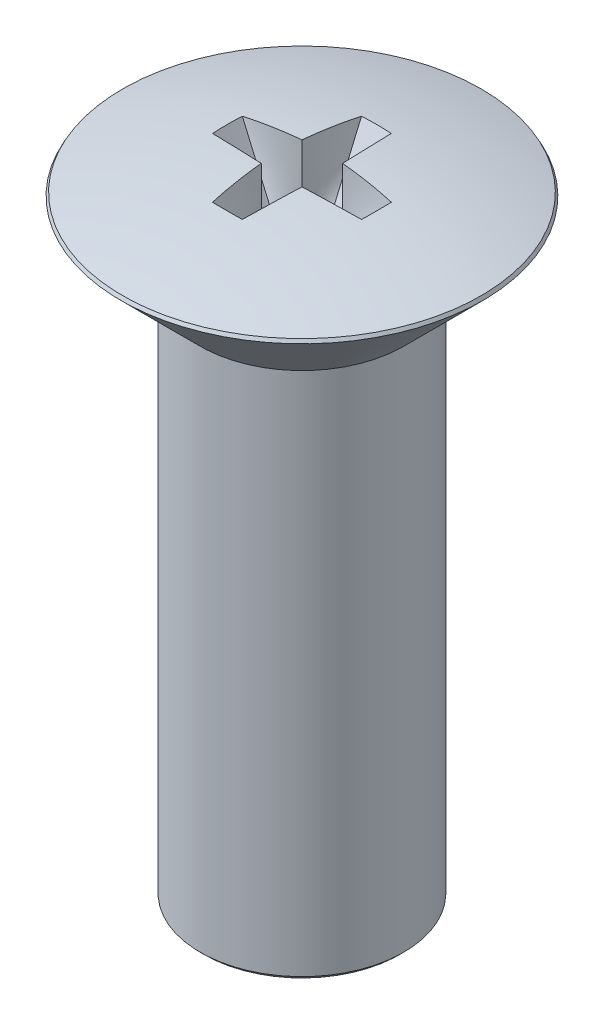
ISO-10303-21;
HEADER;
FILE_DESCRIPTION(('STEP AP214'),'2;1');
FILE_NAME('part.step','',(''),(''),'','','');
FILE_SCHEMA(('AUTOMOTIVE_DESIGN { 1 0 10303 214 1 1 1 1 }'));
ENDSEC;
DATA;
#1=APPLICATION_CONTEXT('core data for automotive mechanical design processes');
#2=APPLICATION_PROTOCOL_DEFINITION('international standard','automotive_design',2000,#1);
#3=PRODUCT_CONTEXT('',#1,'mechanical');
#4=PRODUCT('Part','Part','',(#3));
#5=PRODUCT_RELATED_PRODUCT_CATEGORY('part','',(#4));
#6=PRODUCT_DEFINITION_FORMATION('','',#4);
#7=PRODUCT_DEFINITION_CONTEXT('part definition',#1,'design');
#8=PRODUCT_DEFINITION('design','',#6,#7);
#9=PRODUCT_DEFINITION_SHAPE('','',#8);
#10=(LENGTH_UNIT() NAMED_UNIT(*) SI_UNIT(.MILLI.,.METRE.));
#11=(NAMED_UNIT(*) PLANE_ANGLE_UNIT() SI_UNIT($,.RADIAN.));
#12=(NAMED_UNIT(*) SI_UNIT($,.STERADIAN.) SOLID_ANGLE_UNIT());
#13=UNCERTAINTY_MEASURE_WITH_UNIT(LENGTH_MEASURE(1.E-05),#10,'distance_accuracy_value','');
#14=(GEOMETRIC_REPRESENTATION_CONTEXT(3) GLOBAL_UNCERTAINTY_ASSIGNED_CONTEXT((#13)) GLOBAL_UNIT_ASSIGNED_CONTEXT((#10,
#11,#12)) REPRESENTATION_CONTEXT('',''));
#15=CARTESIAN_POINT('',(0.,0.,0.));
#16=DIRECTION('',(0.,0.,1.));
#17=DIRECTION('',(1.,0.,0.));
#18=AXIS2_PLACEMENT_3D('',#15,#16,#17);
#19=CARTESIAN_POINT('',(0.,0.,0.));
#20=DIRECTION('',(0.,-1.,0.));
#21=DIRECTION('',(0.,0.,-1.));
#22=AXIS2_PLACEMENT_3D('',#19,#20,#21);
#23=PLANE('',#22);
#24=CARTESIAN_POINT('',(0.,0.,0.));
#25=DIRECTION('',(0.,-1.,0.));
#26=DIRECTION('',(0.,0.,-1.));
#27=AXIS2_PLACEMENT_3D('',#24,#25,#26);
#28=CIRCLE('',#27,2.4);
#29=CARTESIAN_POINT('',(0.,0.,-2.4));
#30=VERTEX_POINT('',#29);
#31=EDGE_CURVE('E40',#30,#30,#28,.T.);
#32=ORIENTED_EDGE('',*,*,#31,.T.);
#33=EDGE_LOOP('',(#32));
#34=FACE_BOUND('',#33,.T.);
#35=ADVANCED_FACE('F32',(#34),#23,.T.);
#36=CARTESIAN_POINT('',(0.,0.,0.));
#37=DIRECTION('',(0.,-1.,0.));
#38=DIRECTION('',(0.,0.,-1.));
#39=AXIS2_PLACEMENT_3D('',#36,#37,#38);
#40=CYLINDRICAL_SURFACE('',#39,2.5);
#41=CARTESIAN_POINT('',(0.,0.1,0.));
#42=DIRECTION('',(0.,-1.,0.));
#43=DIRECTION('',(0.,0.,-1.));
#44=AXIS2_PLACEMENT_3D('',#41,#42,#43);
#45=CIRCLE('',#44,2.5);
#46=CARTESIAN_POINT('',(0.,0.1,-2.5));
#47=VERTEX_POINT('',#46);
#48=EDGE_CURVE('E11',#47,#47,#45,.F.);
#49=ORIENTED_EDGE('',*,*,#48,.T.);
#50=EDGE_LOOP('',(#49));
#51=FACE_BOUND('',#50,.T.);
#52=CARTESIAN_POINT('',(0.,13.,0.));
#53=DIRECTION('',(0.,-1.,0.));
#54=DIRECTION('',(0.,0.,-1.));
#55=AXIS2_PLACEMENT_3D('',#52,#53,#54);
#56=CIRCLE('',#55,2.5);
#57=CARTESIAN_POINT('',(0.,13.,-2.5));
#58=VERTEX_POINT('',#57);
#59=EDGE_CURVE('E127',#58,#58,#56,.T.);
#60=ORIENTED_EDGE('',*,*,#59,.T.);
#61=EDGE_LOOP('',(#60));
#62=FACE_BOUND('',#61,.T.);
#63=ADVANCED_FACE('F282',(#51,#62),#40,.T.);
#64=CARTESIAN_POINT('',(0.,13.,0.));
#65=DIRECTION('',(0.,1.,0.));
#66=DIRECTION('',(0.,0.,1.));
#67=AXIS2_PLACEMENT_3D('',#64,#65,#66);
#68=CONICAL_SURFACE('',#67,2.5,0.785398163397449);
#69=CARTESIAN_POINT('',(0.,14.9477984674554,0.));
#70=DIRECTION('',(0.,-1.,0.));
#71=DIRECTION('',(0.,0.,-1.));
#72=AXIS2_PLACEMENT_3D('',#69,#70,#71);
#73=CIRCLE('',#72,4.44779846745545);
#74=CARTESIAN_POINT('',(0.,14.9477984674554,-4.44779846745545));
#75=VERTEX_POINT('',#74);
#76=EDGE_CURVE('E340',#75,#75,#73,.T.);
#77=ORIENTED_EDGE('',*,*,#76,.T.);
#78=EDGE_LOOP('',(#77));
#79=FACE_BOUND('',#78,.T.);
#80=ORIENTED_EDGE('',*,*,#59,.F.);
#81=EDGE_LOOP('',(#80));
#82=FACE_BOUND('',#81,.T.);
#83=ADVANCED_FACE('F284',(#79,#82),#68,.T.);
#84=CARTESIAN_POINT('',(0.,0.,0.));
#85=DIRECTION('',(0.,-1.,0.));
#86=DIRECTION('',(1.,0.,0.));
#87=AXIS2_PLACEMENT_3D('',#84,#85,#86);
#88=SPHERICAL_SURFACE('',#87,15.6604597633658);
#89=CARTESIAN_POINT('',(0.,15.0283397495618,0.));
#90=DIRECTION('',(0.,-1.,0.));
#91=DIRECTION('',(0.,0.,-1.));
#92=AXIS2_PLACEMENT_3D('',#89,#90,#91);
#93=CIRCLE('',#92,4.40443008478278);
#94=CARTESIAN_POINT('',(0.,15.0283397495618,-4.40443008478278));
#95=VERTEX_POINT('',#94);
#96=EDGE_CURVE('E346',#95,#95,#93,.F.);
#97=ORIENTED_EDGE('',*,*,#96,.T.);
#98=EDGE_LOOP('',(#97));
#99=FACE_BOUND('',#98,.T.);
#100=CARTESIAN_POINT('',(-0.5,15.644487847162,0.5));
#101=CARTESIAN_POINT('',(-0.484660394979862,15.6378651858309,0.72265930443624));
#102=CARTESIAN_POINT('',(-0.466348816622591,15.6265602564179,0.944985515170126));
#103=CARTESIAN_POINT('',(-0.433294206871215,15.6026379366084,1.27767889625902));
#104=CARTESIAN_POINT('',(-0.421326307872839,15.5934871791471,1.38858230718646));
#105=CARTESIAN_POINT('',(-0.395332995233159,15.572864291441,1.61001796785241));
#106=CARTESIAN_POINT('',(-0.381306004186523,15.5613903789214,1.72054986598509));
#107=CARTESIAN_POINT('',(-0.366160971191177,15.5487645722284,1.83080485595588));
#108=B_SPLINE_CURVE_WITH_KNOTS('',3,(#100,#101,#102,#103,#104,#105,#106,#107),.UNSPECIFIED.,.F.,
.F.,(4,2,2,4),(0.,0.669772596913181,1.00550014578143,1.3414862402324),.UNSPECIFIED.);
#109=CARTESIAN_POINT('',(-0.5,15.644487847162,0.5));
#110=VERTEX_POINT('',#109);
#111=CARTESIAN_POINT('',(-0.366160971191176,15.5487645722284,1.83080485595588));
#112=VERTEX_POINT('',#111);
#113=EDGE_CURVE('E334',#110,#112,#108,.T.);
#114=ORIENTED_EDGE('',*,*,#113,.F.);
#115=CARTESIAN_POINT('',(-1.83080485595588,15.5487645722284,0.366160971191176));
#116=CARTESIAN_POINT('',(-1.71093724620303,15.562491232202,0.382628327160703));
#117=CARTESIAN_POINT('',(-1.59074226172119,15.5748562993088,0.397772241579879));
#118=CARTESIAN_POINT('',(-1.34982389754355,15.5968462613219,0.425653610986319));
#119=CARTESIAN_POINT('',(-1.22910052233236,15.606471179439,0.438391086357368));
#120=CARTESIAN_POINT('',(-0.905917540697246,15.6285105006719,0.4695389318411));
#121=CARTESIAN_POINT('',(-0.703094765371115,15.6384470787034,0.486002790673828));
#122=CARTESIAN_POINT('',(-0.5,15.644487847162,0.5));
#123=B_SPLINE_CURVE_WITH_KNOTS('',3,(#115,#116,#117,#118,#119,#120,#121,#122),.UNSPECIFIED.,.F.,
.F.,(4,2,2,4),(0.,0.365276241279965,0.730549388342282,1.34149837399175),.UNSPECIFIED.);
#124=CARTESIAN_POINT('',(-1.83080485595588,15.5487645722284,0.366160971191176));
#125=VERTEX_POINT('',#124);
#126=EDGE_CURVE('E55',#125,#110,#123,.T.);
#127=ORIENTED_EDGE('',*,*,#126,.F.);
#128=CARTESIAN_POINT('',(-1.83080485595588,15.5487645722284,-0.366160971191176));
#129=CARTESIAN_POINT('',(-1.83406202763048,15.5503422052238,-0.282893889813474));
#130=CARTESIAN_POINT('',(-1.83620737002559,15.5513813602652,-0.199573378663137));
#131=CARTESIAN_POINT('',(-1.83823787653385,15.5523649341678,-0.0358571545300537));
#132=CARTESIAN_POINT('',(-1.83820057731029,15.5523469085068,0.0445373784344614));
#133=CARTESIAN_POINT('',(-1.83605684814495,15.5513085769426,0.20535824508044));
#134=CARTESIAN_POINT('',(-1.83394872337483,15.5502874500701,0.285784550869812));
#135=CARTESIAN_POINT('',(-1.83080485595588,15.5487645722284,0.366160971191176));
#136=B_SPLINE_CURVE_WITH_KNOTS('',3,(#128,#129,#130,#131,#132,#133,#134,#135),.UNSPECIFIED.,.F.,
.F.,(4,2,2,4),(0.,0.250027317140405,0.49117818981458,0.732526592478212),.UNSPECIFIED.);
#137=CARTESIAN_POINT('',(-1.83080485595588,15.5487645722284,-0.366160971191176));
#138=VERTEX_POINT('',#137);
#139=EDGE_CURVE('E181',#138,#125,#136,.T.);
#140=ORIENTED_EDGE('',*,*,#139,.F.);
#141=CARTESIAN_POINT('',(-0.5,15.644487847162,-0.5));
#142=CARTESIAN_POINT('',(-0.722659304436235,15.6378651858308,-0.484660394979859));
#143=CARTESIAN_POINT('',(-0.944985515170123,15.6265602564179,-0.466348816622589));
#144=CARTESIAN_POINT('',(-1.27767889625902,15.6026379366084,-0.433294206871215));
#145=CARTESIAN_POINT('',(-1.38858230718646,15.5934871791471,-0.421326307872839));
#146=CARTESIAN_POINT('',(-1.61001796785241,15.572864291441,-0.39533299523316));
#147=CARTESIAN_POINT('',(-1.72054986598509,15.5613903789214,-0.381306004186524));
#148=CARTESIAN_POINT('',(-1.83080485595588,15.5487645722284,-0.366160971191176));
#149=B_SPLINE_CURVE_WITH_KNOTS('',3,(#141,#142,#143,#144,#145,#146,#147,#148),.UNSPECIFIED.,.F.,
.F.,(4,2,2,4),(0.,0.66977259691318,1.00550014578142,1.3414862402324),.UNSPECIFIED.);
#150=CARTESIAN_POINT('',(-0.5,15.644487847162,-0.5));
#151=VERTEX_POINT('',#150);
#152=EDGE_CURVE('E403',#151,#138,#149,.T.);
#153=ORIENTED_EDGE('',*,*,#152,.F.);
#154=CARTESIAN_POINT('',(-0.366160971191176,15.5487645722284,-1.83080485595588));
#155=CARTESIAN_POINT('',(-0.382628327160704,15.562491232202,-1.71093724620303));
#156=CARTESIAN_POINT('',(-0.397772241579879,15.5748562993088,-1.59074226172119));
#157=CARTESIAN_POINT('',(-0.425653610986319,15.5968462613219,-1.34982389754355));
#158=CARTESIAN_POINT('',(-0.438391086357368,15.606471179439,-1.22910052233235));
#159=CARTESIAN_POINT('',(-0.4695389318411,15.6285105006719,-0.905917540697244));
#160=CARTESIAN_POINT('',(-0.486002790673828,15.6384470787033,-0.703094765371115));
#161=CARTESIAN_POINT('',(-0.5,15.644487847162,-0.5));
#162=B_SPLINE_CURVE_WITH_KNOTS('',3,(#154,#155,#156,#157,#158,#159,#160,#161),.UNSPECIFIED.,.F.,
.F.,(4,2,2,4),(0.,0.365276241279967,0.730549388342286,1.34149837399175),.UNSPECIFIED.);
#163=CARTESIAN_POINT('',(-0.366160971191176,15.5487645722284,-1.83080485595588));
#164=VERTEX_POINT('',#163);
#165=EDGE_CURVE('E216',#164,#151,#162,.T.);
#166=ORIENTED_EDGE('',*,*,#165,.F.);
#167=CARTESIAN_POINT('',(0.366160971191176,15.5487645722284,-1.83080485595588));
#168=CARTESIAN_POINT('',(0.282893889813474,15.5503422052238,-1.83406202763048));
#169=CARTESIAN_POINT('',(0.199573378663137,15.5513813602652,-1.83620737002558));
#170=CARTESIAN_POINT('',(0.0358571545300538,15.5523649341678,-1.83823787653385));
#171=CARTESIAN_POINT('',(-0.0445373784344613,15.5523469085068,-1.83820057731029));
#172=CARTESIAN_POINT('',(-0.20535824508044,15.5513085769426,-1.83605684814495));
#173=CARTESIAN_POINT('',(-0.285784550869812,15.5502874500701,-1.83394872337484));
#174=CARTESIAN_POINT('',(-0.366160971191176,15.5487645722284,-1.83080485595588));
#175=B_SPLINE_CURVE_WITH_KNOTS('',3,(#167,#168,#169,#170,#171,#172,#173,#174),.UNSPECIFIED.,.F.,
.F.,(4,2,2,4),(0.,0.250027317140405,0.49117818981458,0.732526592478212),.UNSPECIFIED.);
#176=CARTESIAN_POINT('',(0.366160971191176,15.5487645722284,-1.83080485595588));
#177=VERTEX_POINT('',#176);
#178=EDGE_CURVE('E209',#177,#164,#175,.T.);
#179=ORIENTED_EDGE('',*,*,#178,.F.);
#180=CARTESIAN_POINT('',(0.5,15.644487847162,-0.5));
#181=CARTESIAN_POINT('',(0.484660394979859,15.6378651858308,-0.722659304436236));
#182=CARTESIAN_POINT('',(0.466348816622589,15.6265602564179,-0.944985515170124));
#183=CARTESIAN_POINT('',(0.433294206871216,15.6026379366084,-1.27767889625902));
#184=CARTESIAN_POINT('',(0.42132630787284,15.5934871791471,-1.38858230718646));
#185=CARTESIAN_POINT('',(0.39533299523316,15.572864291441,-1.61001796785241));
#186=CARTESIAN_POINT('',(0.381306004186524,15.5613903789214,-1.72054986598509));
#187=CARTESIAN_POINT('',(0.366160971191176,15.5487645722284,-1.83080485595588));
#188=B_SPLINE_CURVE_WITH_KNOTS('',3,(#180,#181,#182,#183,#184,#185,#186,#187),.UNSPECIFIED.,.F.,
.F.,(4,2,2,4),(0.,0.669772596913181,1.00550014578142,1.3414862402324),.UNSPECIFIED.);
#189=CARTESIAN_POINT('',(0.5,15.644487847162,-0.5));
#190=VERTEX_POINT('',#189);
#191=EDGE_CURVE('E205',#190,#177,#188,.T.);
#192=ORIENTED_EDGE('',*,*,#191,.F.);
#193=CARTESIAN_POINT('',(1.83080485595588,15.5487645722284,-0.366160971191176));
#194=CARTESIAN_POINT('',(1.71093724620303,15.562491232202,-0.382628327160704));
#195=CARTESIAN_POINT('',(1.59074226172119,15.5748562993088,-0.39777224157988));
#196=CARTESIAN_POINT('',(1.34982389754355,15.5968462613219,-0.42565361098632));
#197=CARTESIAN_POINT('',(1.22910052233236,15.606471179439,-0.438391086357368));
#198=CARTESIAN_POINT('',(0.905917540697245,15.6285105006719,-0.4695389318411));
#199=CARTESIAN_POINT('',(0.703094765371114,15.6384470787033,-0.486002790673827));
#200=CARTESIAN_POINT('',(0.5,15.644487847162,-0.5));
#201=B_SPLINE_CURVE_WITH_KNOTS('',3,(#193,#194,#195,#196,#197,#198,#199,#200),.UNSPECIFIED.,.F.,
.F.,(4,2,2,4),(0.,0.365276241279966,0.730549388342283,1.34149837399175),.UNSPECIFIED.);
#202=CARTESIAN_POINT('',(1.83080485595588,15.5487645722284,-0.366160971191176));
#203=VERTEX_POINT('',#202);
#204=EDGE_CURVE('E218',#203,#190,#201,.T.);
#205=ORIENTED_EDGE('',*,*,#204,.F.);
#206=CARTESIAN_POINT('',(1.83080485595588,15.5487645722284,0.366160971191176));
#207=CARTESIAN_POINT('',(1.83406202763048,15.5503422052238,0.282893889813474));
#208=CARTESIAN_POINT('',(1.83620737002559,15.5513813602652,0.199573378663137));
#209=CARTESIAN_POINT('',(1.83823787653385,15.5523649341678,0.0358571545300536));
#210=CARTESIAN_POINT('',(1.83820057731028,15.5523469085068,-0.0445373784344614));
#211=CARTESIAN_POINT('',(1.83605684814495,15.5513085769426,-0.20535824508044));
#212=CARTESIAN_POINT('',(1.83394872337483,15.5502874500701,-0.285784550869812));
#213=CARTESIAN_POINT('',(1.83080485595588,15.5487645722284,-0.366160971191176));
#214=B_SPLINE_CURVE_WITH_KNOTS('',3,(#206,#207,#208,#209,#210,#211,#212,#213),.UNSPECIFIED.,.F.,
.F.,(4,2,2,4),(0.,0.250027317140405,0.49117818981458,0.732526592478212),.UNSPECIFIED.);
#215=CARTESIAN_POINT('',(1.83080485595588,15.5487645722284,0.366160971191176));
#216=VERTEX_POINT('',#215);
#217=EDGE_CURVE('E217',#216,#203,#214,.T.);
#218=ORIENTED_EDGE('',*,*,#217,.F.);
#219=CARTESIAN_POINT('',(0.5,15.644487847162,0.5));
#220=CARTESIAN_POINT('',(0.722659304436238,15.6378651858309,0.484660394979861));
#221=CARTESIAN_POINT('',(0.944985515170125,15.6265602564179,0.46634881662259));
#222=CARTESIAN_POINT('',(1.27767889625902,15.6026379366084,0.433294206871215));
#223=CARTESIAN_POINT('',(1.38858230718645,15.5934871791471,0.421326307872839));
#224=CARTESIAN_POINT('',(1.61001796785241,15.572864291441,0.395332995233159));
#225=CARTESIAN_POINT('',(1.72054986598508,15.5613903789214,0.381306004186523));
#226=CARTESIAN_POINT('',(1.83080485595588,15.5487645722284,0.366160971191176));
#227=B_SPLINE_CURVE_WITH_KNOTS('',3,(#219,#220,#221,#222,#223,#224,#225,#226),.UNSPECIFIED.,.F.,
.F.,(4,2,2,4),(0.,0.66977259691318,1.00550014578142,1.3414862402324),.UNSPECIFIED.);
#228=CARTESIAN_POINT('',(0.5,15.644487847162,0.5));
#229=VERTEX_POINT('',#228);
#230=EDGE_CURVE('E408',#229,#216,#227,.T.);
#231=ORIENTED_EDGE('',*,*,#230,.F.);
#232=CARTESIAN_POINT('',(0.366160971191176,15.5487645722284,1.83080485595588));
#233=CARTESIAN_POINT('',(0.382628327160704,15.562491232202,1.71093724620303));
#234=CARTESIAN_POINT('',(0.397772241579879,15.5748562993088,1.59074226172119));
#235=CARTESIAN_POINT('',(0.425653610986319,15.5968462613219,1.34982389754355));
#236=CARTESIAN_POINT('',(0.438391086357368,15.606471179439,1.22910052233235));
#237=CARTESIAN_POINT('',(0.4695389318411,15.6285105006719,0.905917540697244));
#238=CARTESIAN_POINT('',(0.486002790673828,15.6384470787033,0.703094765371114));
#239=CARTESIAN_POINT('',(0.5,15.644487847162,0.5));
#240=B_SPLINE_CURVE_WITH_KNOTS('',3,(#232,#233,#234,#235,#236,#237,#238,#239),.UNSPECIFIED.,.F.,
.F.,(4,2,2,4),(0.,0.365276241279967,0.730549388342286,1.34149837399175),.UNSPECIFIED.);
#241=CARTESIAN_POINT('',(0.366160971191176,15.5487645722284,1.83080485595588));
#242=VERTEX_POINT('',#241);
#243=EDGE_CURVE('E398',#242,#229,#240,.T.);
#244=ORIENTED_EDGE('',*,*,#243,.F.);
#245=CARTESIAN_POINT('',(-0.366160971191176,15.5487645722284,1.83080485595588));
#246=CARTESIAN_POINT('',(-0.282893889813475,15.5503422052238,1.83406202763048));
#247=CARTESIAN_POINT('',(-0.199573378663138,15.5513813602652,1.83620737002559));
#248=CARTESIAN_POINT('',(-0.0358571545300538,15.5523649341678,1.83823787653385));
#249=CARTESIAN_POINT('',(0.0445373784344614,15.5523469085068,1.83820057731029));
#250=CARTESIAN_POINT('',(0.205358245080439,15.5513085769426,1.83605684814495));
#251=CARTESIAN_POINT('',(0.285784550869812,15.5502874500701,1.83394872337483));
#252=CARTESIAN_POINT('',(0.366160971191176,15.5487645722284,1.83080485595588));
#253=B_SPLINE_CURVE_WITH_KNOTS('',3,(#245,#246,#247,#248,#249,#250,#251,#252),.UNSPECIFIED.,.F.,
.F.,(4,2,2,4),(0.,0.250027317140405,0.491178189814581,0.732526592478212),.UNSPECIFIED.);
#254=EDGE_CURVE('E351',#112,#242,#253,.T.);
#255=ORIENTED_EDGE('',*,*,#254,.F.);
#256=EDGE_LOOP('',(#114,#127,#140,#153,#166,#179,#192,#205,#218,#231,#244,#255));
#257=FACE_BOUND('',#256,.T.);
#258=ADVANCED_FACE('F213',(#99,#257),#88,.T.);
#259=CARTESIAN_POINT('',(0.,13.66,0.));
#260=DIRECTION('',(0.,1.,0.));
#261=DIRECTION('',(0.,0.,1.));
#262=AXIS2_PLACEMENT_3D('',#259,#260,#261);
#263=PLANE('',#262);
#264=CARTESIAN_POINT('',(0.,13.66,0.));
#265=DIRECTION('',(0.,-1.,0.));
#266=DIRECTION('',(0.,0.,-1.));
#267=AXIS2_PLACEMENT_3D('',#264,#265,#266);
#268=CIRCLE('',#267,0.700241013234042);
#269=CARTESIAN_POINT('',(0.,13.66,0.700241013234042));
#270=VERTEX_POINT('',#269);
#271=EDGE_CURVE('E142',#270,#270,#268,.T.);
#272=ORIENTED_EDGE('',*,*,#271,.T.);
#273=EDGE_LOOP('',(#272));
#274=FACE_BOUND('',#273,.T.);
#275=CARTESIAN_POINT('',(0.,13.66,0.));
#276=DIRECTION('',(0.,1.,0.));
#277=DIRECTION('',(0.,0.,1.));
#278=AXIS2_PLACEMENT_3D('',#275,#276,#277);
#279=CIRCLE('',#278,0.707106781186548);
#280=CARTESIAN_POINT('',(-0.138675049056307,13.66,0.693375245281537));
#281=VERTEX_POINT('',#280);
#282=CARTESIAN_POINT('',(0.138675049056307,13.66,0.693375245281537));
#283=VERTEX_POINT('',#282);
#284=EDGE_CURVE('E143',#281,#283,#279,.T.);
#285=ORIENTED_EDGE('',*,*,#284,.T.);
#286=CARTESIAN_POINT('',(0.5,13.66,0.5));
#287=VERTEX_POINT('',#286);
#288=EDGE_CURVE('E149',#283,#287,#279,.T.);
#289=ORIENTED_EDGE('',*,*,#288,.T.);
#290=CARTESIAN_POINT('',(0.693375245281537,13.66,0.138675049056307));
#291=VERTEX_POINT('',#290);
#292=EDGE_CURVE('E153',#287,#291,#279,.T.);
#293=ORIENTED_EDGE('',*,*,#292,.T.);
#294=CARTESIAN_POINT('',(0.693375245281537,13.66,-0.138675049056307));
#295=VERTEX_POINT('',#294);
#296=EDGE_CURVE('E157',#291,#295,#279,.T.);
#297=ORIENTED_EDGE('',*,*,#296,.T.);
#298=CARTESIAN_POINT('',(0.5,13.66,-0.5));
#299=VERTEX_POINT('',#298);
#300=EDGE_CURVE('E160',#295,#299,#279,.T.);
#301=ORIENTED_EDGE('',*,*,#300,.T.);
#302=CARTESIAN_POINT('',(0.138675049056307,13.66,-0.693375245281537));
#303=VERTEX_POINT('',#302);
#304=EDGE_CURVE('E163',#299,#303,#279,.T.);
#305=ORIENTED_EDGE('',*,*,#304,.T.);
#306=CARTESIAN_POINT('',(-0.138675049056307,13.66,-0.693375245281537));
#307=VERTEX_POINT('',#306);
#308=EDGE_CURVE('E165',#303,#307,#279,.T.);
#309=ORIENTED_EDGE('',*,*,#308,.T.);
#310=CARTESIAN_POINT('',(-0.5,13.66,-0.5));
#311=VERTEX_POINT('',#310);
#312=EDGE_CURVE('E168',#307,#311,#279,.T.);
#313=ORIENTED_EDGE('',*,*,#312,.T.);
#314=CARTESIAN_POINT('',(-0.693375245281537,13.66,-0.138675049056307));
#315=VERTEX_POINT('',#314);
#316=EDGE_CURVE('E171',#311,#315,#279,.T.);
#317=ORIENTED_EDGE('',*,*,#316,.T.);
#318=CARTESIAN_POINT('',(-0.693375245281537,13.66,0.138675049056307));
#319=VERTEX_POINT('',#318);
#320=EDGE_CURVE('E137',#315,#319,#279,.T.);
#321=ORIENTED_EDGE('',*,*,#320,.T.);
#322=CARTESIAN_POINT('',(-0.500000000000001,13.66,0.5));
#323=VERTEX_POINT('',#322);
#324=EDGE_CURVE('E123',#319,#323,#279,.T.);
#325=ORIENTED_EDGE('',*,*,#324,.T.);
#326=EDGE_CURVE('E134',#323,#281,#279,.T.);
#327=ORIENTED_EDGE('',*,*,#326,.T.);
#328=EDGE_LOOP('',(#285,#289,#293,#297,#301,#305,#309,#313,#317,#321,#325,#327));
#329=FACE_BOUND('',#328,.T.);
#330=ADVANCED_FACE('F133',(#274,#329),#263,.T.);
#331=CARTESIAN_POINT('',(-0.5,16.66,2.5));
#332=CARTESIAN_POINT('',(-0.138675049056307,13.66,0.693375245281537));
#333=CARTESIAN_POINT('',(-0.5,16.66,1.83333333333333));
#334=CARTESIAN_POINT('',(-0.27657241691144,13.66,0.66579577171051));
#335=CARTESIAN_POINT('',(-0.5,16.66,1.16666666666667));
#336=CARTESIAN_POINT('',(-0.400560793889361,13.66,0.59943920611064));
#337=CARTESIAN_POINT('',(-0.5,16.66,0.5));
#338=CARTESIAN_POINT('',(-0.500000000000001,13.66,0.5));
#339=(BOUNDED_SURFACE() B_SPLINE_SURFACE(3,1,((#331,#332),(#333,#334),(#335,#336),(#337,#338)),
.UNSPECIFIED.,.F.,.F.,.F.) B_SPLINE_SURFACE_WITH_KNOTS((4,4),(2,2),(0.,1.),(0.,1.),
.UNSPECIFIED.) GEOMETRIC_REPRESENTATION_ITEM() RATIONAL_B_SPLINE_SURFACE(((1.,1.),(1.,
0.971394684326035),(1.,0.971394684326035),(1.,1.))) REPRESENTATION_ITEM('') SURFACE());
#340=DIRECTION('',(-0.10263236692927,0.852133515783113,0.513161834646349));
#341=VECTOR('',#340,1.);
#342=CARTESIAN_POINT('',(-0.319337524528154,15.16,1.59668762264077));
#343=LINE('',#342,#341);
#344=EDGE_CURVE('E128',#281,#112,#343,.T.);
#345=DIRECTION('',(0.,-1.,0.));
#346=VECTOR('',#345,1.);
#347=CARTESIAN_POINT('',(-0.5,15.16,0.5));
#348=LINE('',#347,#346);
#349=EDGE_CURVE('E120',#110,#323,#348,.T.);
#350=ORIENTED_EDGE('',*,*,#113,.T.);
#351=ORIENTED_EDGE('',*,*,#344,.F.);
#352=ORIENTED_EDGE('',*,*,#326,.F.);
#353=ORIENTED_EDGE('',*,*,#349,.F.);
#354=EDGE_LOOP('',(#350,#351,#352,#353));
#355=FACE_BOUND('',#354,.T.);
#356=ADVANCED_FACE('F140',(#355),#339,.F.);
#357=CARTESIAN_POINT('',(-0.5,16.66,0.5));
#358=CARTESIAN_POINT('',(-0.500000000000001,13.66,0.5));
#359=CARTESIAN_POINT('',(-1.16666666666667,16.66,0.5));
#360=CARTESIAN_POINT('',(-0.59943920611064,13.66,0.40056079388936));
#361=CARTESIAN_POINT('',(-1.83333333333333,16.66,0.5));
#362=CARTESIAN_POINT('',(-0.66579577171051,13.66,0.276572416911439));
#363=CARTESIAN_POINT('',(-2.5,16.66,0.5));
#364=CARTESIAN_POINT('',(-0.693375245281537,13.66,0.138675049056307));
#365=(BOUNDED_SURFACE() B_SPLINE_SURFACE(3,1,((#357,#358),(#359,#360),(#361,#362),(#363,#364)),
.UNSPECIFIED.,.F.,.F.,.F.) B_SPLINE_SURFACE_WITH_KNOTS((4,4),(2,2),(0.,1.),(0.,1.),
.UNSPECIFIED.) GEOMETRIC_REPRESENTATION_ITEM() RATIONAL_B_SPLINE_SURFACE(((1.,1.),(1.,
0.971394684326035),(1.,0.971394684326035),(1.,1.))) REPRESENTATION_ITEM('') SURFACE());
#366=DIRECTION('',(0.513161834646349,-0.852133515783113,-0.10263236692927));
#367=VECTOR('',#366,1.);
#368=CARTESIAN_POINT('',(-1.59668762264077,15.16,0.319337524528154));
#369=LINE('',#368,#367);
#370=EDGE_CURVE('E180',#125,#319,#369,.T.);
#371=ORIENTED_EDGE('',*,*,#126,.T.);
#372=ORIENTED_EDGE('',*,*,#349,.T.);
#373=ORIENTED_EDGE('',*,*,#324,.F.);
#374=ORIENTED_EDGE('',*,*,#370,.F.);
#375=EDGE_LOOP('',(#371,#372,#373,#374));
#376=FACE_BOUND('',#375,.T.);
#377=ADVANCED_FACE('F122',(#376),#365,.F.);
#378=CARTESIAN_POINT('',(0.5,16.66,2.5));
#379=CARTESIAN_POINT('',(0.138675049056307,13.66,0.693375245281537));
#380=CARTESIAN_POINT('',(0.166666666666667,16.66,2.5));
#381=CARTESIAN_POINT('',(0.046831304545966,13.66,0.711743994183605));
#382=CARTESIAN_POINT('',(-0.166666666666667,16.66,2.5));
#383=CARTESIAN_POINT('',(-0.0468313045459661,13.66,0.711743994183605));
#384=CARTESIAN_POINT('',(-0.5,16.66,2.5));
#385=CARTESIAN_POINT('',(-0.138675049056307,13.66,0.693375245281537));
#386=(BOUNDED_SURFACE() B_SPLINE_SURFACE(3,1,((#378,#379),(#380,#381),(#382,#383),(#384,#385)),
.UNSPECIFIED.,.F.,.F.,.F.) B_SPLINE_SURFACE_WITH_KNOTS((4,4),(2,2),(0.,1.),(0.,1.),
.UNSPECIFIED.) GEOMETRIC_REPRESENTATION_ITEM() RATIONAL_B_SPLINE_SURFACE(((1.,1.),(1.,
0.987053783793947),(1.,0.987053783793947),(1.,1.))) REPRESENTATION_ITEM('') SURFACE());
#387=DIRECTION('',(0.10263236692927,0.852133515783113,0.513161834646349));
#388=VECTOR('',#387,1.);
#389=CARTESIAN_POINT('',(0.319337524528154,15.16,1.59668762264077));
#390=LINE('',#389,#388);
#391=EDGE_CURVE('E182',#283,#242,#390,.T.);
#392=ORIENTED_EDGE('',*,*,#254,.T.);
#393=ORIENTED_EDGE('',*,*,#391,.F.);
#394=ORIENTED_EDGE('',*,*,#284,.F.);
#395=ORIENTED_EDGE('',*,*,#344,.T.);
#396=EDGE_LOOP('',(#392,#393,#394,#395));
#397=FACE_BOUND('',#396,.T.);
#398=ADVANCED_FACE('F316',(#397),#386,.F.);
#399=CARTESIAN_POINT('',(-2.5,16.66,0.5));
#400=CARTESIAN_POINT('',(-0.693375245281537,13.66,0.138675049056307));
#401=CARTESIAN_POINT('',(-2.5,16.66,0.166666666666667));
#402=CARTESIAN_POINT('',(-0.711743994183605,13.66,0.0468313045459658));
#403=CARTESIAN_POINT('',(-2.5,16.66,-0.166666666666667));
#404=CARTESIAN_POINT('',(-0.711743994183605,13.66,-0.0468313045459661));
#405=CARTESIAN_POINT('',(-2.5,16.66,-0.5));
#406=CARTESIAN_POINT('',(-0.693375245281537,13.66,-0.138675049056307));
#407=(BOUNDED_SURFACE() B_SPLINE_SURFACE(3,1,((#399,#400),(#401,#402),(#403,#404),(#405,#406)),
.UNSPECIFIED.,.F.,.F.,.F.) B_SPLINE_SURFACE_WITH_KNOTS((4,4),(2,2),(0.,1.),(0.,1.),
.UNSPECIFIED.) GEOMETRIC_REPRESENTATION_ITEM() RATIONAL_B_SPLINE_SURFACE(((1.,1.),(1.,
0.987053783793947),(1.,0.987053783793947),(1.,1.))) REPRESENTATION_ITEM('') SURFACE());
#408=DIRECTION('',(0.51316183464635,-0.852133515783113,0.10263236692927));
#409=VECTOR('',#408,1.);
#410=CARTESIAN_POINT('',(-1.59668762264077,15.16,-0.319337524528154));
#411=LINE('',#410,#409);
#412=EDGE_CURVE('E178',#138,#315,#411,.T.);
#413=ORIENTED_EDGE('',*,*,#139,.T.);
#414=ORIENTED_EDGE('',*,*,#370,.T.);
#415=ORIENTED_EDGE('',*,*,#320,.F.);
#416=ORIENTED_EDGE('',*,*,#412,.F.);
#417=EDGE_LOOP('',(#413,#414,#415,#416));
#418=FACE_BOUND('',#417,.T.);
#419=ADVANCED_FACE('F177',(#418),#407,.F.);
#420=CARTESIAN_POINT('',(0.5,16.66,0.5));
#421=CARTESIAN_POINT('',(0.5,13.66,0.5));
#422=CARTESIAN_POINT('',(0.5,16.66,1.16666666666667));
#423=CARTESIAN_POINT('',(0.40056079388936,13.66,0.59943920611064));
#424=CARTESIAN_POINT('',(0.5,16.66,1.83333333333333));
#425=CARTESIAN_POINT('',(0.27657241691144,13.66,0.66579577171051));
#426=CARTESIAN_POINT('',(0.5,16.66,2.5));
#427=CARTESIAN_POINT('',(0.138675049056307,13.66,0.693375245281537));
#428=(BOUNDED_SURFACE() B_SPLINE_SURFACE(3,1,((#420,#421),(#422,#423),(#424,#425),(#426,#427)),
.UNSPECIFIED.,.F.,.F.,.F.) B_SPLINE_SURFACE_WITH_KNOTS((4,4),(2,2),(0.,1.),(0.,1.),
.UNSPECIFIED.) GEOMETRIC_REPRESENTATION_ITEM() RATIONAL_B_SPLINE_SURFACE(((1.,1.),(1.,
0.971394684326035),(1.,0.971394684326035),(1.,1.))) REPRESENTATION_ITEM('') SURFACE());
#429=DIRECTION('',(0.,1.,0.));
#430=VECTOR('',#429,1.);
#431=CARTESIAN_POINT('',(0.5,15.16,0.5));
#432=LINE('',#431,#430);
#433=EDGE_CURVE('E189',#287,#229,#432,.T.);
#434=ORIENTED_EDGE('',*,*,#243,.T.);
#435=ORIENTED_EDGE('',*,*,#433,.F.);
#436=ORIENTED_EDGE('',*,*,#288,.F.);
#437=ORIENTED_EDGE('',*,*,#391,.T.);
#438=EDGE_LOOP('',(#434,#435,#436,#437));
#439=FACE_BOUND('',#438,.T.);
#440=ADVANCED_FACE('F376',(#439),#428,.F.);
#441=CARTESIAN_POINT('',(-2.5,16.66,-0.5));
#442=CARTESIAN_POINT('',(-0.693375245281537,13.66,-0.138675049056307));
#443=CARTESIAN_POINT('',(-1.83333333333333,16.66,-0.5));
#444=CARTESIAN_POINT('',(-0.66579577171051,13.66,-0.27657241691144));
#445=CARTESIAN_POINT('',(-1.16666666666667,16.66,-0.5));
#446=CARTESIAN_POINT('',(-0.59943920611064,13.66,-0.40056079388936));
#447=CARTESIAN_POINT('',(-0.5,16.66,-0.5));
#448=CARTESIAN_POINT('',(-0.5,13.66,-0.5));
#449=(BOUNDED_SURFACE() B_SPLINE_SURFACE(3,1,((#441,#442),(#443,#444),(#445,#446),(#447,#448)),
.UNSPECIFIED.,.F.,.F.,.F.) B_SPLINE_SURFACE_WITH_KNOTS((4,4),(2,2),(0.,1.),(0.,1.),
.UNSPECIFIED.) GEOMETRIC_REPRESENTATION_ITEM() RATIONAL_B_SPLINE_SURFACE(((1.,1.),(1.,
0.971394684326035),(1.,0.971394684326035),(1.,1.))) REPRESENTATION_ITEM('') SURFACE());
#450=DIRECTION('',(0.,-1.,0.));
#451=VECTOR('',#450,1.);
#452=CARTESIAN_POINT('',(-0.5,15.16,-0.5));
#453=LINE('',#452,#451);
#454=EDGE_CURVE('E192',#151,#311,#453,.T.);
#455=ORIENTED_EDGE('',*,*,#152,.T.);
#456=ORIENTED_EDGE('',*,*,#412,.T.);
#457=ORIENTED_EDGE('',*,*,#316,.F.);
#458=ORIENTED_EDGE('',*,*,#454,.F.);
#459=EDGE_LOOP('',(#455,#456,#457,#458));
#460=FACE_BOUND('',#459,.T.);
#461=ADVANCED_FACE('F387',(#460),#449,.F.);
#462=CARTESIAN_POINT('',(2.5,16.66,0.5));
#463=CARTESIAN_POINT('',(0.693375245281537,13.66,0.138675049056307));
#464=CARTESIAN_POINT('',(1.83333333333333,16.66,0.5));
#465=CARTESIAN_POINT('',(0.66579577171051,13.66,0.27657241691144));
#466=CARTESIAN_POINT('',(1.16666666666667,16.66,0.5));
#467=CARTESIAN_POINT('',(0.59943920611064,13.66,0.40056079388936));
#468=CARTESIAN_POINT('',(0.5,16.66,0.5));
#469=CARTESIAN_POINT('',(0.5,13.66,0.5));
#470=(BOUNDED_SURFACE() B_SPLINE_SURFACE(3,1,((#462,#463),(#464,#465),(#466,#467),(#468,#469)),
.UNSPECIFIED.,.F.,.F.,.F.) B_SPLINE_SURFACE_WITH_KNOTS((4,4),(2,2),(0.,1.),(0.,1.),
.UNSPECIFIED.) GEOMETRIC_REPRESENTATION_ITEM() RATIONAL_B_SPLINE_SURFACE(((1.,1.),(1.,
0.971394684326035),(1.,0.971394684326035),(1.,1.))) REPRESENTATION_ITEM('') SURFACE());
#471=DIRECTION('',(0.51316183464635,0.852133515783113,0.10263236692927));
#472=VECTOR('',#471,1.);
#473=CARTESIAN_POINT('',(1.59668762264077,15.16,0.319337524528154));
#474=LINE('',#473,#472);
#475=EDGE_CURVE('E194',#291,#216,#474,.T.);
#476=ORIENTED_EDGE('',*,*,#230,.T.);
#477=ORIENTED_EDGE('',*,*,#475,.F.);
#478=ORIENTED_EDGE('',*,*,#292,.F.);
#479=ORIENTED_EDGE('',*,*,#433,.T.);
#480=EDGE_LOOP('',(#476,#477,#478,#479));
#481=FACE_BOUND('',#480,.T.);
#482=ADVANCED_FACE('F415',(#481),#470,.F.);
#483=CARTESIAN_POINT('',(-0.5,16.66,-0.5));
#484=CARTESIAN_POINT('',(-0.5,13.66,-0.5));
#485=CARTESIAN_POINT('',(-0.5,16.66,-1.16666666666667));
#486=CARTESIAN_POINT('',(-0.40056079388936,13.66,-0.59943920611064));
#487=CARTESIAN_POINT('',(-0.5,16.66,-1.83333333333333));
#488=CARTESIAN_POINT('',(-0.27657241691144,13.66,-0.66579577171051));
#489=CARTESIAN_POINT('',(-0.5,16.66,-2.5));
#490=CARTESIAN_POINT('',(-0.138675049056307,13.66,-0.693375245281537));
#491=(BOUNDED_SURFACE() B_SPLINE_SURFACE(3,1,((#483,#484),(#485,#486),(#487,#488),(#489,#490)),
.UNSPECIFIED.,.F.,.F.,.F.) B_SPLINE_SURFACE_WITH_KNOTS((4,4),(2,2),(0.,1.),(0.,1.),
.UNSPECIFIED.) GEOMETRIC_REPRESENTATION_ITEM() RATIONAL_B_SPLINE_SURFACE(((1.,1.),(1.,
0.971394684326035),(1.,0.971394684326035),(1.,1.))) REPRESENTATION_ITEM('') SURFACE());
#492=DIRECTION('',(0.10263236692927,-0.852133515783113,0.513161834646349));
#493=VECTOR('',#492,1.);
#494=CARTESIAN_POINT('',(-0.319337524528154,15.16,-1.59668762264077));
#495=LINE('',#494,#493);
#496=EDGE_CURVE('E197',#164,#307,#495,.T.);
#497=ORIENTED_EDGE('',*,*,#165,.T.);
#498=ORIENTED_EDGE('',*,*,#454,.T.);
#499=ORIENTED_EDGE('',*,*,#312,.F.);
#500=ORIENTED_EDGE('',*,*,#496,.F.);
#501=EDGE_LOOP('',(#497,#498,#499,#500));
#502=FACE_BOUND('',#501,.T.);
#503=ADVANCED_FACE('F420',(#502),#491,.F.);
#504=CARTESIAN_POINT('',(2.5,16.66,-0.5));
#505=CARTESIAN_POINT('',(0.693375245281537,13.66,-0.138675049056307));
#506=CARTESIAN_POINT('',(2.5,16.66,-0.166666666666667));
#507=CARTESIAN_POINT('',(0.711743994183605,13.66,-0.0468313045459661));
#508=CARTESIAN_POINT('',(2.5,16.66,0.166666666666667));
#509=CARTESIAN_POINT('',(0.711743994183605,13.66,0.046831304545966));
#510=CARTESIAN_POINT('',(2.5,16.66,0.5));
#511=CARTESIAN_POINT('',(0.693375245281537,13.66,0.138675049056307));
#512=(BOUNDED_SURFACE() B_SPLINE_SURFACE(3,1,((#504,#505),(#506,#507),(#508,#509),(#510,#511)),
.UNSPECIFIED.,.F.,.F.,.F.) B_SPLINE_SURFACE_WITH_KNOTS((4,4),(2,2),(0.,1.),(0.,1.),
.UNSPECIFIED.) GEOMETRIC_REPRESENTATION_ITEM() RATIONAL_B_SPLINE_SURFACE(((1.,1.),(1.,
0.987053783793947),(1.,0.987053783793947),(1.,1.))) REPRESENTATION_ITEM('') SURFACE());
#513=DIRECTION('',(0.51316183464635,0.852133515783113,-0.10263236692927));
#514=VECTOR('',#513,1.);
#515=CARTESIAN_POINT('',(1.59668762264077,15.16,-0.319337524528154));
#516=LINE('',#515,#514);
#517=EDGE_CURVE('E199',#295,#203,#516,.T.);
#518=ORIENTED_EDGE('',*,*,#217,.T.);
#519=ORIENTED_EDGE('',*,*,#517,.F.);
#520=ORIENTED_EDGE('',*,*,#296,.F.);
#521=ORIENTED_EDGE('',*,*,#475,.T.);
#522=EDGE_LOOP('',(#518,#519,#520,#521));
#523=FACE_BOUND('',#522,.T.);
#524=ADVANCED_FACE('F245',(#523),#512,.F.);
#525=CARTESIAN_POINT('',(-0.5,16.66,-2.5));
#526=CARTESIAN_POINT('',(-0.138675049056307,13.66,-0.693375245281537));
#527=CARTESIAN_POINT('',(-0.166666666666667,16.66,-2.5));
#528=CARTESIAN_POINT('',(-0.0468313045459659,13.66,-0.711743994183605));
#529=CARTESIAN_POINT('',(0.166666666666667,16.66,-2.5));
#530=CARTESIAN_POINT('',(0.0468313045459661,13.66,-0.711743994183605));
#531=CARTESIAN_POINT('',(0.5,16.66,-2.5));
#532=CARTESIAN_POINT('',(0.138675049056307,13.66,-0.693375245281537));
#533=(BOUNDED_SURFACE() B_SPLINE_SURFACE(3,1,((#525,#526),(#527,#528),(#529,#530),(#531,#532)),
.UNSPECIFIED.,.F.,.F.,.F.) B_SPLINE_SURFACE_WITH_KNOTS((4,4),(2,2),(0.,1.),(0.,1.),
.UNSPECIFIED.) GEOMETRIC_REPRESENTATION_ITEM() RATIONAL_B_SPLINE_SURFACE(((1.,1.),(1.,
0.987053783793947),(1.,0.987053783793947),(1.,1.))) REPRESENTATION_ITEM('') SURFACE());
#534=DIRECTION('',(-0.10263236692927,-0.852133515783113,0.513161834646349));
#535=VECTOR('',#534,1.);
#536=CARTESIAN_POINT('',(0.319337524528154,15.16,-1.59668762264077));
#537=LINE('',#536,#535);
#538=EDGE_CURVE('E152',#177,#303,#537,.T.);
#539=ORIENTED_EDGE('',*,*,#178,.T.);
#540=ORIENTED_EDGE('',*,*,#496,.T.);
#541=ORIENTED_EDGE('',*,*,#308,.F.);
#542=ORIENTED_EDGE('',*,*,#538,.F.);
#543=EDGE_LOOP('',(#539,#540,#541,#542));
#544=FACE_BOUND('',#543,.T.);
#545=ADVANCED_FACE('F208',(#544),#533,.F.);
#546=CARTESIAN_POINT('',(0.5,16.66,-0.5));
#547=CARTESIAN_POINT('',(0.5,13.66,-0.5));
#548=CARTESIAN_POINT('',(1.16666666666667,16.66,-0.5));
#549=CARTESIAN_POINT('',(0.59943920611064,13.66,-0.40056079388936));
#550=CARTESIAN_POINT('',(1.83333333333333,16.66,-0.5));
#551=CARTESIAN_POINT('',(0.66579577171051,13.66,-0.27657241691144));
#552=CARTESIAN_POINT('',(2.5,16.66,-0.5));
#553=CARTESIAN_POINT('',(0.693375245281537,13.66,-0.138675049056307));
#554=(BOUNDED_SURFACE() B_SPLINE_SURFACE(3,1,((#546,#547),(#548,#549),(#550,#551),(#552,#553)),
.UNSPECIFIED.,.F.,.F.,.F.) B_SPLINE_SURFACE_WITH_KNOTS((4,4),(2,2),(0.,1.),(0.,1.),
.UNSPECIFIED.) GEOMETRIC_REPRESENTATION_ITEM() RATIONAL_B_SPLINE_SURFACE(((1.,1.),(1.,
0.971394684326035),(1.,0.971394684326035),(1.,1.))) REPRESENTATION_ITEM('') SURFACE());
#555=DIRECTION('',(0.,1.,0.));
#556=VECTOR('',#555,1.);
#557=CARTESIAN_POINT('',(0.5,15.16,-0.5));
#558=LINE('',#557,#556);
#559=EDGE_CURVE('E47',#299,#190,#558,.T.);
#560=ORIENTED_EDGE('',*,*,#204,.T.);
#561=ORIENTED_EDGE('',*,*,#559,.F.);
#562=ORIENTED_EDGE('',*,*,#300,.F.);
#563=ORIENTED_EDGE('',*,*,#517,.T.);
#564=EDGE_LOOP('',(#560,#561,#562,#563));
#565=FACE_BOUND('',#564,.T.);
#566=ADVANCED_FACE('F244',(#565),#554,.F.);
#567=CARTESIAN_POINT('',(0.5,16.66,-2.5));
#568=CARTESIAN_POINT('',(0.138675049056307,13.66,-0.693375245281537));
#569=CARTESIAN_POINT('',(0.5,16.66,-1.83333333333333));
#570=CARTESIAN_POINT('',(0.27657241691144,13.66,-0.66579577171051));
#571=CARTESIAN_POINT('',(0.5,16.66,-1.16666666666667));
#572=CARTESIAN_POINT('',(0.40056079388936,13.66,-0.59943920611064));
#573=CARTESIAN_POINT('',(0.5,16.66,-0.5));
#574=CARTESIAN_POINT('',(0.5,13.66,-0.5));
#575=(BOUNDED_SURFACE() B_SPLINE_SURFACE(3,1,((#567,#568),(#569,#570),(#571,#572),(#573,#574)),
.UNSPECIFIED.,.F.,.F.,.F.) B_SPLINE_SURFACE_WITH_KNOTS((4,4),(2,2),(0.,1.),(0.,1.),
.UNSPECIFIED.) GEOMETRIC_REPRESENTATION_ITEM() RATIONAL_B_SPLINE_SURFACE(((1.,1.),(1.,
0.971394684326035),(1.,0.971394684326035),(1.,1.))) REPRESENTATION_ITEM('') SURFACE());
#576=ORIENTED_EDGE('',*,*,#191,.T.);
#577=ORIENTED_EDGE('',*,*,#538,.T.);
#578=ORIENTED_EDGE('',*,*,#304,.F.);
#579=ORIENTED_EDGE('',*,*,#559,.T.);
#580=EDGE_LOOP('',(#576,#577,#578,#579));
#581=FACE_BOUND('',#580,.T.);
#582=ADVANCED_FACE('F203',(#581),#575,.F.);
#583=CARTESIAN_POINT('',(0.,14.9477984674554,0.));
#584=DIRECTION('',(0.,-1.,0.));
#585=DIRECTION('',(0.,0.,-1.));
#586=AXIS2_PLACEMENT_3D('',#583,#584,#585);
#587=CONICAL_SURFACE('',#586,4.44779846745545,0.493941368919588);
#588=ORIENTED_EDGE('',*,*,#96,.F.);
#589=EDGE_LOOP('',(#588));
#590=FACE_BOUND('',#589,.T.);
#591=ORIENTED_EDGE('',*,*,#76,.F.);
#592=EDGE_LOOP('',(#591));
#593=FACE_BOUND('',#592,.T.);
#594=ADVANCED_FACE('F270',(#590,#593),#587,.T.);
#595=CARTESIAN_POINT('',(0.,0.,0.));
#596=DIRECTION('',(0.,1.,0.));
#597=DIRECTION('',(0.,0.,1.));
#598=AXIS2_PLACEMENT_3D('',#595,#596,#597);
#599=CONICAL_SURFACE('',#598,2.4,0.785398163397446);
#600=ORIENTED_EDGE('',*,*,#48,.F.);
#601=EDGE_LOOP('',(#600));
#602=FACE_BOUND('',#601,.T.);
#603=ORIENTED_EDGE('',*,*,#31,.F.);
#604=EDGE_LOOP('',(#603));
#605=FACE_BOUND('',#604,.T.);
#606=ADVANCED_FACE('F34',(#602,#605),#599,.T.);
#607=CARTESIAN_POINT('',(0.,11.16,0.));
#608=DIRECTION('',(0.,1.,0.));
#609=DIRECTION('',(0.,0.,1.));
#610=AXIS2_PLACEMENT_3D('',#607,#608,#609);
#611=CONICAL_SURFACE('',#610,0.1,0.23563613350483);
#612=CARTESIAN_POINT('',(0.,11.16,0.));
#613=DIRECTION('',(0.,-1.,0.));
#614=DIRECTION('',(0.,0.,-1.));
#615=AXIS2_PLACEMENT_3D('',#612,#613,#614);
#616=CIRCLE('',#615,0.1);
#617=CARTESIAN_POINT('',(0.,11.16,0.1));
#618=VERTEX_POINT('',#617);
#619=EDGE_CURVE('E145',#618,#618,#616,.T.);
#620=CARTESIAN_POINT('',(0.,13.66,0.700241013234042));
#621=CARTESIAN_POINT('',(0.,13.6339583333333,0.69398850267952));
#622=CARTESIAN_POINT('',(0.,13.6079166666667,0.687735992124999));
#623=CARTESIAN_POINT('',(0.,13.5558333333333,0.675230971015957));
#624=CARTESIAN_POINT('',(0.,13.5297916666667,0.668978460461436));
#625=CARTESIAN_POINT('',(0.,13.4777083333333,0.656473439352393));
#626=CARTESIAN_POINT('',(0.,13.4516666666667,0.650220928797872));
#627=CARTESIAN_POINT('',(0.,13.3995833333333,0.637715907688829));
#628=CARTESIAN_POINT('',(0.,13.3735416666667,0.631463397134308));
#629=CARTESIAN_POINT('',(0.,13.3214583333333,0.618958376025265));
#630=CARTESIAN_POINT('',(0.,13.2954166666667,0.612705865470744));
#631=CARTESIAN_POINT('',(0.,13.2433333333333,0.600200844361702));
#632=CARTESIAN_POINT('',(0.,13.2172916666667,0.59394833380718));
#633=CARTESIAN_POINT('',(0.,13.1652083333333,0.581443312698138));
#634=CARTESIAN_POINT('',(0.,13.1391666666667,0.575190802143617));
#635=CARTESIAN_POINT('',(0.,13.0870833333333,0.562685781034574));
#636=CARTESIAN_POINT('',(0.,13.0610416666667,0.556433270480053));
#637=CARTESIAN_POINT('',(0.,13.0089583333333,0.54392824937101));
#638=CARTESIAN_POINT('',(0.,12.9829166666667,0.537675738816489));
#639=CARTESIAN_POINT('',(0.,12.9308333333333,0.525170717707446));
#640=CARTESIAN_POINT('',(0.,12.9047916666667,0.518918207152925));
#641=CARTESIAN_POINT('',(0.,12.8527083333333,0.506413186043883));
#642=CARTESIAN_POINT('',(0.,12.8266666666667,0.500160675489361));
#643=CARTESIAN_POINT('',(0.,12.7745833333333,0.487655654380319));
#644=CARTESIAN_POINT('',(0.,12.7485416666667,0.481403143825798));
#645=CARTESIAN_POINT('',(0.,12.6964583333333,0.468898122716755));
#646=CARTESIAN_POINT('',(0.,12.6704166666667,0.462645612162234));
#647=CARTESIAN_POINT('',(0.,12.6183333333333,0.450140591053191));
#648=CARTESIAN_POINT('',(0.,12.5922916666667,0.44388808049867));
#649=CARTESIAN_POINT('',(0.,12.5402083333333,0.431383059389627));
#650=CARTESIAN_POINT('',(0.,12.5141666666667,0.425130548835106));
#651=CARTESIAN_POINT('',(0.,12.4620833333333,0.412625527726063));
#652=CARTESIAN_POINT('',(0.,12.4360416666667,0.406373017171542));
#653=CARTESIAN_POINT('',(0.,12.3839583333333,0.3938679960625));
#654=CARTESIAN_POINT('',(0.,12.3579166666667,0.387615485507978));
#655=CARTESIAN_POINT('',(0.,12.3058333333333,0.375110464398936));
#656=CARTESIAN_POINT('',(0.,12.2797916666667,0.368857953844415));
#657=CARTESIAN_POINT('',(0.,12.2277083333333,0.356352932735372));
#658=CARTESIAN_POINT('',(0.,12.2016666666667,0.350100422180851));
#659=CARTESIAN_POINT('',(0.,12.1495833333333,0.337595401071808));
#660=CARTESIAN_POINT('',(0.,12.1235416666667,0.331342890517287));
#661=CARTESIAN_POINT('',(0.,12.0714583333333,0.318837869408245));
#662=CARTESIAN_POINT('',(0.,12.0454166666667,0.312585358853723));
#663=CARTESIAN_POINT('',(0.,11.9933333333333,0.300080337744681));
#664=CARTESIAN_POINT('',(0.,11.9672916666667,0.293827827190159));
#665=CARTESIAN_POINT('',(0.,11.9152083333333,0.281322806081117));
#666=CARTESIAN_POINT('',(0.,11.8891666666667,0.275070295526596));
#667=CARTESIAN_POINT('',(0.,11.8370833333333,0.262565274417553));
#668=CARTESIAN_POINT('',(0.,11.8110416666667,0.256312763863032));
#669=CARTESIAN_POINT('',(0.,11.7589583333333,0.243807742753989));
#670=CARTESIAN_POINT('',(0.,11.7329166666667,0.237555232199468));
#671=CARTESIAN_POINT('',(0.,11.6808333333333,0.225050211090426));
#672=CARTESIAN_POINT('',(0.,11.6547916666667,0.218797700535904));
#673=CARTESIAN_POINT('',(0.,11.6027083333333,0.206292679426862));
#674=CARTESIAN_POINT('',(0.,11.5766666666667,0.200040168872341));
#675=CARTESIAN_POINT('',(0.,11.5245833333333,0.187535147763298));
#676=CARTESIAN_POINT('',(0.,11.4985416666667,0.181282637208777));
#677=CARTESIAN_POINT('',(0.,11.4464583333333,0.168777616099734));
#678=CARTESIAN_POINT('',(0.,11.4204166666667,0.162525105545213));
#679=CARTESIAN_POINT('',(0.,11.3683333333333,0.15002008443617));
#680=CARTESIAN_POINT('',(0.,11.3422916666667,0.143767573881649));
#681=CARTESIAN_POINT('',(0.,11.2902083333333,0.131262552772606));
#682=CARTESIAN_POINT('',(0.,11.2641666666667,0.125010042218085));
#683=CARTESIAN_POINT('',(0.,11.2120833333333,0.112505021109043));
#684=CARTESIAN_POINT('',(0.,11.1860416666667,0.106252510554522));
#685=CARTESIAN_POINT('',(0.,11.16,0.1));
#686=B_SPLINE_CURVE_WITH_KNOTS('',3,(#620,#621,#622,#623,#624,#625,#626,#627,#628,#629,#630,
#631,#632,#633,#634,#635,#636,#637,#638,#639,#640,#641,#642,#643,#644,#645,#646,#647,#648,#649,
#650,#651,#652,#653,#654,#655,#656,#657,#658,#659,#660,#661,#662,#663,#664,#665,#666,#667,#668,
#669,#670,#671,#672,#673,#674,#675,#676,#677,#678,#679,#680,#681,#682,#683,#684,#685),
.UNSPECIFIED.,.F.,.F.,(4,2,2,2,2,2,2,2,2,2,2,2,2,2,2,2,2,2,2,2,2,2,2,2,2,2,2,2,2,2,2,2,4),(0.,
0.0803452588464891,0.160690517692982,0.241035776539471,0.321381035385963,0.401726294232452,
0.482071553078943,0.562416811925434,0.642762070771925,0.723107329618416,0.803452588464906,
0.883797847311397,0.964143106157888,1.04448836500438,1.12483362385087,1.20517888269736,
1.28552414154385,1.36586940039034,1.44621465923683,1.52655991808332,1.60690517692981,
1.68725043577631,1.7675956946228,1.84794095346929,1.92828621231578,2.00863147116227,
2.08897673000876,2.16932198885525,2.24966724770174,2.33001250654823,2.41035776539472,
2.49070302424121,2.5710482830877),.UNSPECIFIED.);
#687=EDGE_CURVE('BSEAM306',#270,#618,#686,.T.);
#688=ORIENTED_EDGE('',*,*,#271,.F.);
#689=ORIENTED_EDGE('',*,*,#619,.T.);
#690=ORIENTED_EDGE('',*,*,#687,.T.);
#691=ORIENTED_EDGE('',*,*,#687,.F.);
#692=EDGE_LOOP('',(#688,#690,#689,#691));
#693=FACE_BOUND('',#692,.T.);
#694=ADVANCED_FACE('F306',(#693),#611,.F.);
#695=CARTESIAN_POINT('',(-0.1,11.16,0.));
#696=DIRECTION('',(0.,-1.,0.));
#697=DIRECTION('',(0.,0.,-1.));
#698=AXIS2_PLACEMENT_3D('',#695,#696,#697);
#699=PLANE('',#698);
#700=ORIENTED_EDGE('',*,*,#619,.F.);
#701=EDGE_LOOP('',(#700));
#702=FACE_BOUND('',#701,.T.);
#703=ADVANCED_FACE('F529',(#702),#699,.F.);
#704=CLOSED_SHELL('',(#35,#63,#83,#258,#330,#356,#377,#398,#419,#440,#461,#482,#503,#524,#545,
#566,#582,#594,#606,#694,#703));
#705=MANIFOLD_SOLID_BREP('B2',#704);
#706=ADVANCED_BREP_SHAPE_REPRESENTATION('',(#18,#705),#14);
#707=SHAPE_DEFINITION_REPRESENTATION(#9,#706);
ENDSEC;
END-ISO-10303-21;
